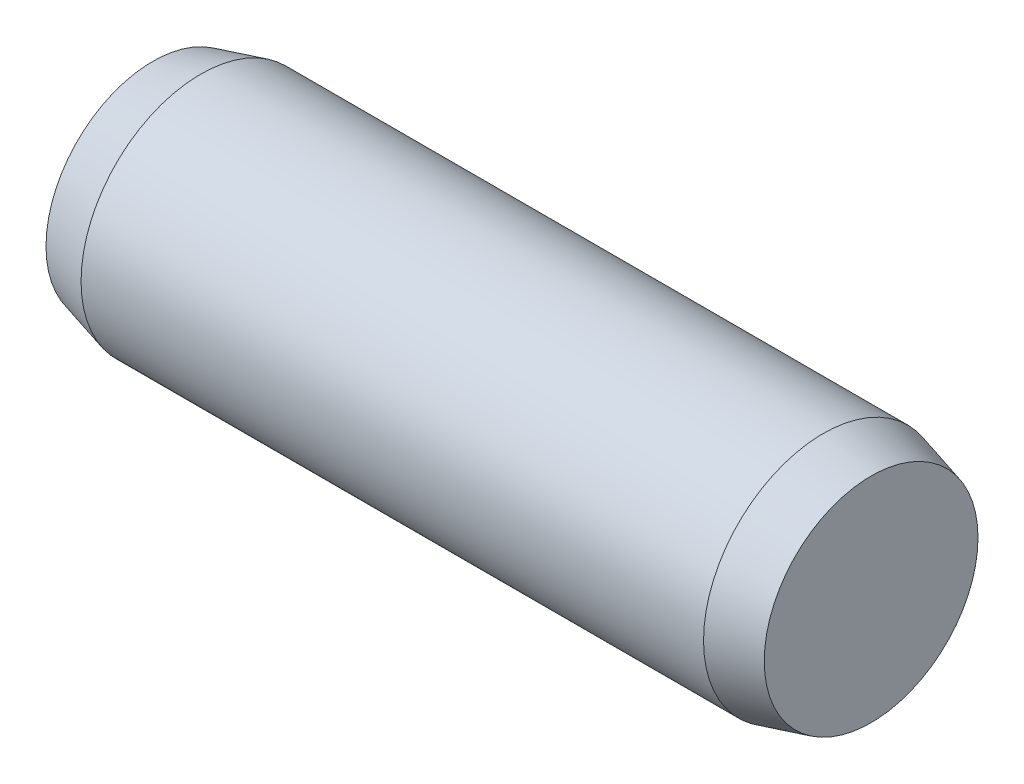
from build123d import *


with BuildPart() as part:
    # BodySke → BaseBody (revolve)
    with BuildSketch(Plane(origin=(0, 0, 0), x_dir=(1, 0, 0), z_dir=(0, 1, 0)), mode=Mode.PRIVATE) as basebody_sk:
        Polygon((0, 0), (30, 0), (30, 4.464101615), (28, 5), (2, 5), (0, 4.464101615), align=None)
    revolve(basebody_sk.sketch.rotate(Axis((0, 0, 0), (1, 0, 0)), 180), axis=Axis((0, 0, 0), (1, 0, 0)))


solid = part.part
